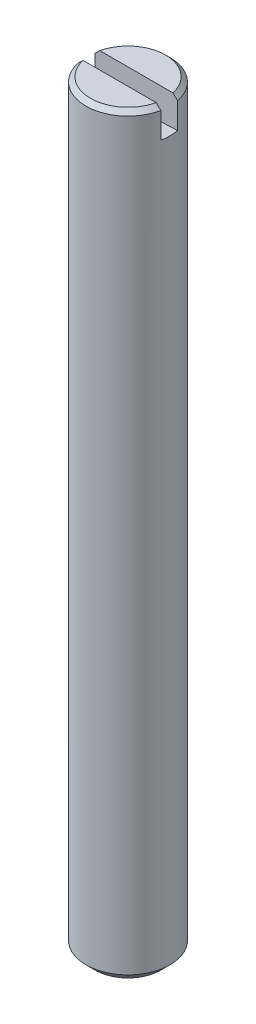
ISO-10303-21;
HEADER;
FILE_DESCRIPTION(('STEP AP214'),'2;1');
FILE_NAME('part.step','',(''),(''),'','','');
FILE_SCHEMA(('AUTOMOTIVE_DESIGN { 1 0 10303 214 1 1 1 1 }'));
ENDSEC;
DATA;
#1=APPLICATION_CONTEXT('core data for automotive mechanical design processes');
#2=APPLICATION_PROTOCOL_DEFINITION('international standard','automotive_design',2000,#1);
#3=PRODUCT_CONTEXT('',#1,'mechanical');
#4=PRODUCT('Part','Part','',(#3));
#5=PRODUCT_RELATED_PRODUCT_CATEGORY('part','',(#4));
#6=PRODUCT_DEFINITION_FORMATION('','',#4);
#7=PRODUCT_DEFINITION_CONTEXT('part definition',#1,'design');
#8=PRODUCT_DEFINITION('design','',#6,#7);
#9=PRODUCT_DEFINITION_SHAPE('','',#8);
#10=(LENGTH_UNIT() NAMED_UNIT(*) SI_UNIT(.MILLI.,.METRE.));
#11=(NAMED_UNIT(*) PLANE_ANGLE_UNIT() SI_UNIT($,.RADIAN.));
#12=(NAMED_UNIT(*) SI_UNIT($,.STERADIAN.) SOLID_ANGLE_UNIT());
#13=UNCERTAINTY_MEASURE_WITH_UNIT(LENGTH_MEASURE(1.E-05),#10,'distance_accuracy_value','');
#14=(GEOMETRIC_REPRESENTATION_CONTEXT(3) GLOBAL_UNCERTAINTY_ASSIGNED_CONTEXT((#13)) GLOBAL_UNIT_ASSIGNED_CONTEXT((#10,
#11,#12)) REPRESENTATION_CONTEXT('',''));
#15=CARTESIAN_POINT('',(0.,0.,0.));
#16=DIRECTION('',(0.,0.,1.));
#17=DIRECTION('',(1.,0.,0.));
#18=AXIS2_PLACEMENT_3D('',#15,#16,#17);
#19=CARTESIAN_POINT('',(0.,31.,0.));
#20=DIRECTION('',(0.,-1.,0.));
#21=DIRECTION('',(0.,0.,-1.));
#22=AXIS2_PLACEMENT_3D('',#19,#20,#21);
#23=PLANE('',#22);
#24=CARTESIAN_POINT('',(0.,31.0000000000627,0.));
#25=DIRECTION('',(0.,-1.,0.));
#26=DIRECTION('',(0.,0.,-1.));
#27=AXIS2_PLACEMENT_3D('',#24,#25,#26);
#28=CIRCLE('',#27,1.78549999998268);
#29=CARTESIAN_POINT('',(-1.74011788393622,31.0000000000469,-0.4));
#30=VERTEX_POINT('',#29);
#31=CARTESIAN_POINT('',(1.74011788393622,31.0000000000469,-0.4));
#32=VERTEX_POINT('',#31);
#33=EDGE_CURVE('E88',#30,#32,#28,.T.);
#34=ORIENTED_EDGE('',*,*,#33,.F.);
#35=DIRECTION('',(1.,0.,0.));
#36=VECTOR('',#35,1.);
#37=CARTESIAN_POINT('',(0.,31.,-0.4));
#38=LINE('',#37,#36);
#39=EDGE_CURVE('E20',#32,#30,#38,.F.);
#40=ORIENTED_EDGE('',*,*,#39,.F.);
#41=EDGE_LOOP('',(#34,#40));
#42=FACE_BOUND('',#41,.T.);
#43=ADVANCED_FACE('F15',(#42),#23,.F.);
#44=CARTESIAN_POINT('',(0.,31.,0.));
#45=DIRECTION('',(0.,-1.,0.));
#46=DIRECTION('',(0.,0.,-1.));
#47=AXIS2_PLACEMENT_3D('',#44,#45,#46);
#48=PLANE('',#47);
#49=DIRECTION('',(1.,0.,0.));
#50=VECTOR('',#49,1.);
#51=CARTESIAN_POINT('',(0.,31.,0.4));
#52=LINE('',#51,#50);
#53=CARTESIAN_POINT('',(-1.74011788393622,31.0000000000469,0.4));
#54=VERTEX_POINT('',#53);
#55=CARTESIAN_POINT('',(1.74011788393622,31.0000000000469,0.4));
#56=VERTEX_POINT('',#55);
#57=EDGE_CURVE('E82',#54,#56,#52,.T.);
#58=ORIENTED_EDGE('',*,*,#57,.F.);
#59=CARTESIAN_POINT('',(0.,31.0000000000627,0.));
#60=DIRECTION('',(0.,-1.,0.));
#61=DIRECTION('',(0.,0.,-1.));
#62=AXIS2_PLACEMENT_3D('',#59,#60,#61);
#63=CIRCLE('',#62,1.78549999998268);
#64=EDGE_CURVE('E75',#56,#54,#63,.T.);
#65=ORIENTED_EDGE('',*,*,#64,.F.);
#66=EDGE_LOOP('',(#58,#65));
#67=FACE_BOUND('',#66,.T.);
#68=ADVANCED_FACE('F87',(#67),#48,.F.);
#69=CARTESIAN_POINT('',(0.,30.7855000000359,0.));
#70=DIRECTION('',(0.,-1.,0.));
#71=DIRECTION('',(0.,0.,-1.));
#72=AXIS2_PLACEMENT_3D('',#69,#70,#71);
#73=CONICAL_SURFACE('',#72,1.9999999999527,0.785398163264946);
#74=CARTESIAN_POINT('',(-1.74011788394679,31.0000000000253,-0.399999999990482));
#75=CARTESIAN_POINT('',(-1.77674437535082,30.964298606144,-0.399999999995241));
#76=CARTESIAN_POINT('',(-1.8133471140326,30.928572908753,-0.399999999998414));
#77=CARTESIAN_POINT('',(-1.88650508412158,30.8570729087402,-0.400000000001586));
#78=CARTESIAN_POINT('',(-1.92306031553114,30.8212986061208,-0.400000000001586));
#79=CARTESIAN_POINT('',(-1.95959179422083,30.7854999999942,-0.4));
#80=B_SPLINE_CURVE_WITH_KNOTS('',3,(#74,#75,#76,#77,#78,#79),.UNSPECIFIED.,.F.,.F.,(4,2,4),(0.,
0.153443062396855,0.306886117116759),.UNSPECIFIED.);
#81=CARTESIAN_POINT('',(-1.95959179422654,30.7854999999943,-0.4));
#82=VERTEX_POINT('',#81);
#83=EDGE_CURVE('E86',#30,#82,#80,.T.);
#84=ORIENTED_EDGE('',*,*,#83,.F.);
#85=ORIENTED_EDGE('',*,*,#33,.T.);
#86=CARTESIAN_POINT('',(1.95959179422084,30.7854999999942,-0.4));
#87=CARTESIAN_POINT('',(1.9230603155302,30.8212986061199,-0.4));
#88=CARTESIAN_POINT('',(1.88650508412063,30.8570729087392,-0.4));
#89=CARTESIAN_POINT('',(1.81334711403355,30.9285729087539,-0.4));
#90=CARTESIAN_POINT('',(1.77674437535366,30.9642986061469,-0.4));
#91=CARTESIAN_POINT('',(1.74011788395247,31.0000000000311,-0.4));
#92=B_SPLINE_CURVE_WITH_KNOTS('',3,(#86,#87,#88,#89,#90,#91),.UNSPECIFIED.,.F.,.F.,(4,2,4),(0.,
0.153443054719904,0.306886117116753),.UNSPECIFIED.);
#93=CARTESIAN_POINT('',(1.95959179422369,30.7854999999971,-0.4));
#94=VERTEX_POINT('',#93);
#95=EDGE_CURVE('E113',#94,#32,#92,.T.);
#96=ORIENTED_EDGE('',*,*,#95,.F.);
#97=CARTESIAN_POINT('',(0.,30.7855,0.));
#98=DIRECTION('',(0.,-1.,0.));
#99=DIRECTION('',(0.,0.,-1.));
#100=AXIS2_PLACEMENT_3D('',#97,#98,#99);
#101=CIRCLE('',#100,2.);
#102=EDGE_CURVE('E102',#82,#94,#101,.T.);
#103=ORIENTED_EDGE('',*,*,#102,.F.);
#104=EDGE_LOOP('',(#84,#85,#96,#103));
#105=FACE_BOUND('',#104,.T.);
#106=ADVANCED_FACE('F129',(#105),#73,.T.);
#107=CARTESIAN_POINT('',(0.,61.,-0.4));
#108=DIRECTION('',(0.,0.,1.));
#109=DIRECTION('',(1.,0.,0.));
#110=AXIS2_PLACEMENT_3D('',#107,#108,#109);
#111=PLANE('',#110);
#112=ORIENTED_EDGE('',*,*,#39,.T.);
#113=ORIENTED_EDGE('',*,*,#83,.T.);
#114=DIRECTION('',(0.,1.,0.));
#115=VECTOR('',#114,1.);
#116=CARTESIAN_POINT('',(-1.95959179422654,61.,-0.4));
#117=LINE('',#116,#115);
#118=CARTESIAN_POINT('',(-1.95959179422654,29.5610114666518,-0.4));
#119=VERTEX_POINT('',#118);
#120=EDGE_CURVE('E59',#82,#119,#117,.F.);
#121=ORIENTED_EDGE('',*,*,#120,.T.);
#122=CARTESIAN_POINT('',(0.,61.,-0.4));
#123=DIRECTION('',(0.,0.,-1.));
#124=DIRECTION('',(-1.,0.,0.));
#125=AXIS2_PLACEMENT_3D('',#122,#123,#124);
#126=CIRCLE('',#125,31.5);
#127=CARTESIAN_POINT('',(1.95959179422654,29.5610114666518,-0.4));
#128=VERTEX_POINT('',#127);
#129=EDGE_CURVE('E110',#119,#128,#126,.F.);
#130=ORIENTED_EDGE('',*,*,#129,.T.);
#131=DIRECTION('',(0.,1.,0.));
#132=VECTOR('',#131,1.);
#133=CARTESIAN_POINT('',(1.95959179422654,61.,-0.4));
#134=LINE('',#133,#132);
#135=EDGE_CURVE('E111',#128,#94,#134,.T.);
#136=ORIENTED_EDGE('',*,*,#135,.T.);
#137=ORIENTED_EDGE('',*,*,#95,.T.);
#138=EDGE_LOOP('',(#112,#113,#121,#130,#136,#137));
#139=FACE_BOUND('',#138,.T.);
#140=ADVANCED_FACE('F125',(#139),#111,.T.);
#141=CARTESIAN_POINT('',(0.,30.7855000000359,0.));
#142=DIRECTION('',(0.,-1.,0.));
#143=DIRECTION('',(0.,0.,-1.));
#144=AXIS2_PLACEMENT_3D('',#141,#142,#143);
#145=CONICAL_SURFACE('',#144,1.9999999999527,0.785398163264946);
#146=ORIENTED_EDGE('',*,*,#64,.T.);
#147=CARTESIAN_POINT('',(-1.74011788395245,31.0000000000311,0.4));
#148=CARTESIAN_POINT('',(-1.77674437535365,30.9642986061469,0.4));
#149=CARTESIAN_POINT('',(-1.81334711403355,30.928572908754,0.4));
#150=CARTESIAN_POINT('',(-1.88650508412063,30.8570729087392,0.4));
#151=CARTESIAN_POINT('',(-1.9230603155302,30.8212986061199,0.4));
#152=CARTESIAN_POINT('',(-1.95959179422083,30.7854999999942,0.4));
#153=B_SPLINE_CURVE_WITH_KNOTS('',3,(#147,#148,#149,#150,#151,#152),.UNSPECIFIED.,.F.,.F.,(4,2,
4),(0.,0.153443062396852,0.306886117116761),.UNSPECIFIED.);
#154=CARTESIAN_POINT('',(-1.95959179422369,30.7854999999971,0.4));
#155=VERTEX_POINT('',#154);
#156=EDGE_CURVE('E35',#54,#155,#153,.T.);
#157=ORIENTED_EDGE('',*,*,#156,.T.);
#158=CARTESIAN_POINT('',(0.,30.7855,0.));
#159=DIRECTION('',(0.,-1.,0.));
#160=DIRECTION('',(0.,0.,-1.));
#161=AXIS2_PLACEMENT_3D('',#158,#159,#160);
#162=CIRCLE('',#161,2.);
#163=CARTESIAN_POINT('',(1.95959179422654,30.7854999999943,0.4));
#164=VERTEX_POINT('',#163);
#165=EDGE_CURVE('E76',#164,#155,#162,.T.);
#166=ORIENTED_EDGE('',*,*,#165,.F.);
#167=CARTESIAN_POINT('',(1.95959179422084,30.7854999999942,0.4));
#168=CARTESIAN_POINT('',(1.9230603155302,30.8212986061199,0.4));
#169=CARTESIAN_POINT('',(1.88650508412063,30.8570729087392,0.4));
#170=CARTESIAN_POINT('',(1.81334711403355,30.928572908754,0.4));
#171=CARTESIAN_POINT('',(1.77674437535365,30.9642986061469,0.4));
#172=CARTESIAN_POINT('',(1.74011788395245,31.0000000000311,0.4));
#173=B_SPLINE_CURVE_WITH_KNOTS('',3,(#167,#168,#169,#170,#171,#172),.UNSPECIFIED.,.F.,.F.,(4,2,
4),(0.,0.153443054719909,0.306886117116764),.UNSPECIFIED.);
#174=EDGE_CURVE('E71',#164,#56,#173,.T.);
#175=ORIENTED_EDGE('',*,*,#174,.T.);
#176=EDGE_LOOP('',(#146,#157,#166,#175));
#177=FACE_BOUND('',#176,.T.);
#178=ADVANCED_FACE('F73',(#177),#145,.T.);
#179=CARTESIAN_POINT('',(0.,61.,0.4));
#180=DIRECTION('',(0.,0.,1.));
#181=DIRECTION('',(1.,0.,0.));
#182=AXIS2_PLACEMENT_3D('',#179,#180,#181);
#183=PLANE('',#182);
#184=ORIENTED_EDGE('',*,*,#57,.T.);
#185=ORIENTED_EDGE('',*,*,#174,.F.);
#186=DIRECTION('',(0.,1.,0.));
#187=VECTOR('',#186,1.);
#188=CARTESIAN_POINT('',(1.95959179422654,61.,0.4));
#189=LINE('',#188,#187);
#190=CARTESIAN_POINT('',(1.95959179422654,29.5610114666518,0.4));
#191=VERTEX_POINT('',#190);
#192=EDGE_CURVE('E79',#191,#164,#189,.T.);
#193=ORIENTED_EDGE('',*,*,#192,.F.);
#194=CARTESIAN_POINT('',(0.,61.,0.4));
#195=DIRECTION('',(0.,0.,-1.));
#196=DIRECTION('',(-1.,0.,0.));
#197=AXIS2_PLACEMENT_3D('',#194,#195,#196);
#198=CIRCLE('',#197,31.5);
#199=CARTESIAN_POINT('',(-1.95959179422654,29.5610114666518,0.4));
#200=VERTEX_POINT('',#199);
#201=EDGE_CURVE('E107',#200,#191,#198,.F.);
#202=ORIENTED_EDGE('',*,*,#201,.F.);
#203=DIRECTION('',(0.,1.,0.));
#204=VECTOR('',#203,1.);
#205=CARTESIAN_POINT('',(-1.95959179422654,61.,0.4));
#206=LINE('',#205,#204);
#207=EDGE_CURVE('E105',#155,#200,#206,.F.);
#208=ORIENTED_EDGE('',*,*,#207,.F.);
#209=ORIENTED_EDGE('',*,*,#156,.F.);
#210=EDGE_LOOP('',(#184,#185,#193,#202,#208,#209));
#211=FACE_BOUND('',#210,.T.);
#212=ADVANCED_FACE('F83',(#211),#183,.F.);
#213=CARTESIAN_POINT('',(0.,61.,0.4));
#214=DIRECTION('',(0.,0.,-1.));
#215=DIRECTION('',(-1.,0.,0.));
#216=AXIS2_PLACEMENT_3D('',#213,#214,#215);
#217=CYLINDRICAL_SURFACE('',#216,31.5);
#218=CARTESIAN_POINT('',(1.95959179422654,29.5610114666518,-0.4));
#219=CARTESIAN_POINT('',(1.97091486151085,29.5617184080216,-0.344561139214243));
#220=CARTESIAN_POINT('',(1.97987306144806,29.562281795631,-0.288637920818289));
#221=CARTESIAN_POINT('',(1.99302430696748,29.5631121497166,-0.1762131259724));
#222=CARTESIAN_POINT('',(1.99721579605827,29.5633790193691,-0.119711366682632));
#223=CARTESIAN_POINT('',(2.0007609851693,29.5636046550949,-0.00749894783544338));
#224=CARTESIAN_POINT('',(2.00019410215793,29.5635684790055,0.0482092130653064));
#225=CARTESIAN_POINT('',(1.99441663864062,29.5632012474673,0.15936012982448));
#226=CARTESIAN_POINT('',(1.98920814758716,29.5628703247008,0.21480299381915));
#227=CARTESIAN_POINT('',(1.97576492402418,29.562023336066,0.313516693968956));
#228=CARTESIAN_POINT('',(1.96839158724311,29.561560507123,0.356906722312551));
#229=CARTESIAN_POINT('',(1.95959179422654,29.5610114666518,0.4));
#230=B_SPLINE_CURVE_WITH_KNOTS('',3,(#218,#219,#220,#221,#222,#223,#224,#225,#226,#227,#228,
#229),.UNSPECIFIED.,.F.,.F.,(4,2,2,2,2,4),(0.,0.169712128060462,0.33947965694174,
0.506419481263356,0.673284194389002,0.805229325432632),.UNSPECIFIED.);
#231=EDGE_CURVE('E26',#128,#191,#230,.T.);
#232=ORIENTED_EDGE('',*,*,#231,.F.);
#233=ORIENTED_EDGE('',*,*,#129,.F.);
#234=CARTESIAN_POINT('',(-1.95959179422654,29.5610114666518,0.4));
#235=CARTESIAN_POINT('',(-1.97091486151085,29.5617184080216,0.344561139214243));
#236=CARTESIAN_POINT('',(-1.97987306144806,29.562281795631,0.288637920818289));
#237=CARTESIAN_POINT('',(-1.99302430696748,29.5631121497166,0.176213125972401));
#238=CARTESIAN_POINT('',(-1.99721579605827,29.5633790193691,0.119711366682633));
#239=CARTESIAN_POINT('',(-2.0007609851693,29.5636046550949,0.00749894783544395));
#240=CARTESIAN_POINT('',(-2.00019410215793,29.5635684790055,-0.0482092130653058));
#241=CARTESIAN_POINT('',(-1.99441663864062,29.5632012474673,-0.159360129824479));
#242=CARTESIAN_POINT('',(-1.98920814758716,29.5628703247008,-0.214802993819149));
#243=CARTESIAN_POINT('',(-1.97576492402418,29.562023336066,-0.313516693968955));
#244=CARTESIAN_POINT('',(-1.96839158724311,29.561560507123,-0.356906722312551));
#245=CARTESIAN_POINT('',(-1.95959179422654,29.5610114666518,-0.4));
#246=B_SPLINE_CURVE_WITH_KNOTS('',3,(#234,#235,#236,#237,#238,#239,#240,#241,#242,#243,#244,
#245),.UNSPECIFIED.,.F.,.F.,(4,2,2,2,2,4),(0.,0.169712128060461,0.33947965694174,
0.506419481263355,0.673284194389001,0.805229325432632),.UNSPECIFIED.);
#247=EDGE_CURVE('E10',#200,#119,#246,.T.);
#248=ORIENTED_EDGE('',*,*,#247,.F.);
#249=ORIENTED_EDGE('',*,*,#201,.T.);
#250=EDGE_LOOP('',(#232,#233,#248,#249));
#251=FACE_BOUND('',#250,.T.);
#252=ADVANCED_FACE('F152',(#251),#217,.F.);
#253=CARTESIAN_POINT('',(0.,21.5,0.));
#254=DIRECTION('',(0.,-1.,0.));
#255=DIRECTION('',(0.,0.,-1.));
#256=AXIS2_PLACEMENT_3D('',#253,#254,#255);
#257=CYLINDRICAL_SURFACE('',#256,2.);
#258=ORIENTED_EDGE('',*,*,#231,.T.);
#259=ORIENTED_EDGE('',*,*,#192,.T.);
#260=ORIENTED_EDGE('',*,*,#165,.T.);
#261=ORIENTED_EDGE('',*,*,#207,.T.);
#262=ORIENTED_EDGE('',*,*,#247,.T.);
#263=ORIENTED_EDGE('',*,*,#120,.F.);
#264=ORIENTED_EDGE('',*,*,#102,.T.);
#265=ORIENTED_EDGE('',*,*,#135,.F.);
#266=EDGE_LOOP('',(#258,#259,#260,#261,#262,#263,#264,#265));
#267=FACE_BOUND('',#266,.T.);
#268=CARTESIAN_POINT('',(0.,-4.5705,0.));
#269=DIRECTION('',(0.,-1.,0.));
#270=DIRECTION('',(0.,0.,-1.));
#271=AXIS2_PLACEMENT_3D('',#268,#269,#270);
#272=CIRCLE('',#271,2.);
#273=CARTESIAN_POINT('',(0.,-4.5705,-2.));
#274=VERTEX_POINT('',#273);
#275=EDGE_CURVE('E104',#274,#274,#272,.T.);
#276=ORIENTED_EDGE('',*,*,#275,.F.);
#277=EDGE_LOOP('',(#276));
#278=FACE_BOUND('',#277,.T.);
#279=ADVANCED_FACE('F17',(#267,#278),#257,.T.);
#280=CARTESIAN_POINT('',(1.5705,-5.,0.));
#281=DIRECTION('',(0.,1.,0.));
#282=DIRECTION('',(0.,0.,1.));
#283=AXIS2_PLACEMENT_3D('',#280,#281,#282);
#284=PLANE('',#283);
#285=CARTESIAN_POINT('',(0.,-5.00000000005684,0.));
#286=DIRECTION('',(0.,1.,0.));
#287=DIRECTION('',(-1.,0.,0.));
#288=AXIS2_PLACEMENT_3D('',#285,#286,#287);
#289=CIRCLE('',#288,1.57050000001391);
#290=CARTESIAN_POINT('',(-1.57050000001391,-5.00000000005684,0.));
#291=VERTEX_POINT('',#290);
#292=EDGE_CURVE('E172',#291,#291,#289,.T.);
#293=ORIENTED_EDGE('',*,*,#292,.F.);
#294=EDGE_LOOP('',(#293));
#295=FACE_BOUND('',#294,.T.);
#296=ADVANCED_FACE('F158',(#295),#284,.F.);
#297=CARTESIAN_POINT('',(0.,-4.57050000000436,0.));
#298=DIRECTION('',(0.,1.,0.));
#299=DIRECTION('',(-1.,0.,0.));
#300=AXIS2_PLACEMENT_3D('',#297,#298,#299);
#301=CONICAL_SURFACE('',#300,2.00000000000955,0.785398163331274);
#302=ORIENTED_EDGE('',*,*,#275,.T.);
#303=EDGE_LOOP('',(#302));
#304=FACE_BOUND('',#303,.T.);
#305=ORIENTED_EDGE('',*,*,#292,.T.);
#306=EDGE_LOOP('',(#305));
#307=FACE_BOUND('',#306,.T.);
#308=ADVANCED_FACE('F178',(#304,#307),#301,.T.);
#309=CLOSED_SHELL('',(#43,#68,#106,#140,#178,#212,#252,#279,#296,#308));
#310=MANIFOLD_SOLID_BREP('B1',#309);
#311=ADVANCED_BREP_SHAPE_REPRESENTATION('',(#18,#310),#14);
#312=SHAPE_DEFINITION_REPRESENTATION(#9,#311);
ENDSEC;
END-ISO-10303-21;
